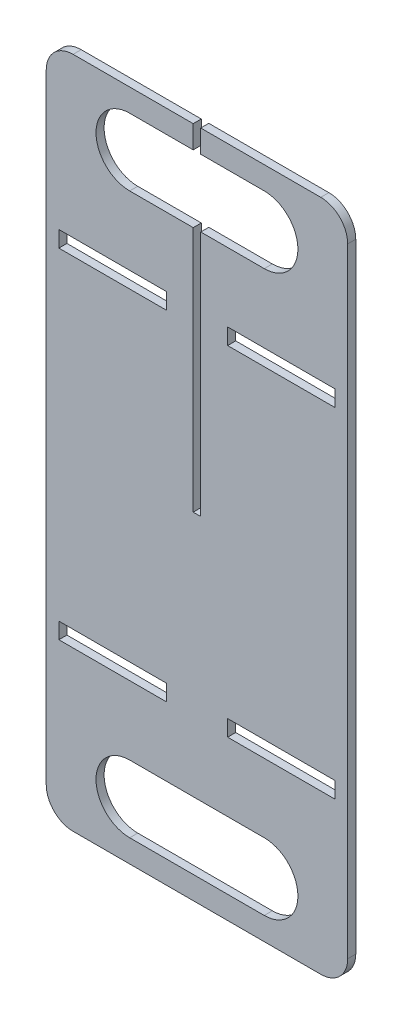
ISO-10303-21;
HEADER;
FILE_DESCRIPTION(('STEP AP214'),'2;1');
FILE_NAME('part.step','',(''),(''),'','','');
FILE_SCHEMA(('AUTOMOTIVE_DESIGN { 1 0 10303 214 1 1 1 1 }'));
ENDSEC;
DATA;
#1=APPLICATION_CONTEXT('core data for automotive mechanical design processes');
#2=APPLICATION_PROTOCOL_DEFINITION('international standard','automotive_design',2000,#1);
#3=PRODUCT_CONTEXT('',#1,'mechanical');
#4=PRODUCT('Part','Part','',(#3));
#5=PRODUCT_RELATED_PRODUCT_CATEGORY('part','',(#4));
#6=PRODUCT_DEFINITION_FORMATION('','',#4);
#7=PRODUCT_DEFINITION_CONTEXT('part definition',#1,'design');
#8=PRODUCT_DEFINITION('design','',#6,#7);
#9=PRODUCT_DEFINITION_SHAPE('','',#8);
#10=(LENGTH_UNIT() NAMED_UNIT(*) SI_UNIT(.MILLI.,.METRE.));
#11=(NAMED_UNIT(*) PLANE_ANGLE_UNIT() SI_UNIT($,.RADIAN.));
#12=(NAMED_UNIT(*) SI_UNIT($,.STERADIAN.) SOLID_ANGLE_UNIT());
#13=UNCERTAINTY_MEASURE_WITH_UNIT(LENGTH_MEASURE(1.E-05),#10,'distance_accuracy_value','');
#14=(GEOMETRIC_REPRESENTATION_CONTEXT(3) GLOBAL_UNCERTAINTY_ASSIGNED_CONTEXT((#13)) GLOBAL_UNIT_ASSIGNED_CONTEXT((#10,
#11,#12)) REPRESENTATION_CONTEXT('',''));
#15=CARTESIAN_POINT('',(0.,0.,0.));
#16=DIRECTION('',(0.,0.,1.));
#17=DIRECTION('',(1.,0.,0.));
#18=AXIS2_PLACEMENT_3D('',#15,#16,#17);
#19=CARTESIAN_POINT('',(0.,0.,3.));
#20=DIRECTION('',(0.,0.,-1.));
#21=DIRECTION('',(-1.,0.,0.));
#22=AXIS2_PLACEMENT_3D('',#19,#20,#21);
#23=PLANE('',#22);
#24=DIRECTION('',(1.,0.,0.));
#25=VECTOR('',#24,1.);
#26=CARTESIAN_POINT('',(25.,-91.5535472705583,3.));
#27=LINE('',#26,#25);
#28=CARTESIAN_POINT('',(-25.,-91.5535472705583,3.));
#29=VERTEX_POINT('',#28);
#30=CARTESIAN_POINT('',(25.,-91.5535472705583,3.));
#31=VERTEX_POINT('',#30);
#32=EDGE_CURVE('E347',#29,#31,#27,.T.);
#33=ORIENTED_EDGE('',*,*,#32,.T.);
#34=CARTESIAN_POINT('',(25.,-104.053547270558,3.));
#35=DIRECTION('',(0.,0.,-1.));
#36=DIRECTION('',(-1.,0.,0.));
#37=AXIS2_PLACEMENT_3D('',#34,#35,#36);
#38=CIRCLE('',#37,12.5);
#39=CARTESIAN_POINT('',(25.,-116.553547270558,3.));
#40=VERTEX_POINT('',#39);
#41=EDGE_CURVE('E337',#31,#40,#38,.T.);
#42=ORIENTED_EDGE('',*,*,#41,.T.);
#43=DIRECTION('',(-1.,0.,0.));
#44=VECTOR('',#43,1.);
#45=CARTESIAN_POINT('',(25.,-116.553547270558,3.));
#46=LINE('',#45,#44);
#47=CARTESIAN_POINT('',(-25.,-116.553547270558,3.));
#48=VERTEX_POINT('',#47);
#49=EDGE_CURVE('E340',#40,#48,#46,.T.);
#50=ORIENTED_EDGE('',*,*,#49,.T.);
#51=CARTESIAN_POINT('',(-25.,-104.053547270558,3.));
#52=DIRECTION('',(0.,0.,-1.));
#53=DIRECTION('',(-1.,0.,0.));
#54=AXIS2_PLACEMENT_3D('',#51,#52,#53);
#55=CIRCLE('',#54,12.5);
#56=EDGE_CURVE('E344',#48,#29,#55,.T.);
#57=ORIENTED_EDGE('',*,*,#56,.T.);
#58=EDGE_LOOP('',(#33,#42,#50,#57));
#59=FACE_BOUND('',#58,.T.);
#60=DIRECTION('',(0.,1.,0.));
#61=VECTOR('',#60,1.);
#62=CARTESIAN_POINT('',(-11.4,-59.9999999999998,3.));
#63=LINE('',#62,#61);
#64=CARTESIAN_POINT('',(-11.4,-65.9999999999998,3.));
#65=VERTEX_POINT('',#64);
#66=CARTESIAN_POINT('',(-11.4,-59.9999999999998,3.));
#67=VERTEX_POINT('',#66);
#68=EDGE_CURVE('E402',#65,#67,#63,.T.);
#69=ORIENTED_EDGE('',*,*,#68,.F.);
#70=DIRECTION('',(1.,0.,0.));
#71=VECTOR('',#70,1.);
#72=CARTESIAN_POINT('',(-11.4,-65.9999999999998,3.));
#73=LINE('',#72,#71);
#74=CARTESIAN_POINT('',(-51.3,-65.9999999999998,3.));
#75=VERTEX_POINT('',#74);
#76=EDGE_CURVE('E404',#75,#65,#73,.T.);
#77=ORIENTED_EDGE('',*,*,#76,.F.);
#78=DIRECTION('',(0.,-1.,0.));
#79=VECTOR('',#78,1.);
#80=CARTESIAN_POINT('',(-51.3,-59.9999999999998,3.));
#81=LINE('',#80,#79);
#82=CARTESIAN_POINT('',(-51.3,-59.9999999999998,3.));
#83=VERTEX_POINT('',#82);
#84=EDGE_CURVE('E407',#83,#75,#81,.T.);
#85=ORIENTED_EDGE('',*,*,#84,.F.);
#86=DIRECTION('',(-1.,0.,0.));
#87=VECTOR('',#86,1.);
#88=CARTESIAN_POINT('',(-11.4,-59.9999999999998,3.));
#89=LINE('',#88,#87);
#90=EDGE_CURVE('E410',#67,#83,#89,.T.);
#91=ORIENTED_EDGE('',*,*,#90,.F.);
#92=EDGE_LOOP('',(#69,#77,#85,#91));
#93=FACE_BOUND('',#92,.T.);
#94=DIRECTION('',(1.,0.,0.));
#95=VECTOR('',#94,1.);
#96=CARTESIAN_POINT('',(51.3,66.0000000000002,3.));
#97=LINE('',#96,#95);
#98=CARTESIAN_POINT('',(11.4,66.0000000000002,3.));
#99=VERTEX_POINT('',#98);
#100=CARTESIAN_POINT('',(51.3,66.0000000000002,3.));
#101=VERTEX_POINT('',#100);
#102=EDGE_CURVE('E441',#99,#101,#97,.T.);
#103=ORIENTED_EDGE('',*,*,#102,.T.);
#104=DIRECTION('',(0.,-1.,0.));
#105=VECTOR('',#104,1.);
#106=CARTESIAN_POINT('',(51.3,66.0000000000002,3.));
#107=LINE('',#106,#105);
#108=CARTESIAN_POINT('',(51.3,60.0000000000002,3.));
#109=VERTEX_POINT('',#108);
#110=EDGE_CURVE('E431',#101,#109,#107,.T.);
#111=ORIENTED_EDGE('',*,*,#110,.T.);
#112=DIRECTION('',(-1.,0.,0.));
#113=VECTOR('',#112,1.);
#114=CARTESIAN_POINT('',(51.3,60.0000000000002,3.));
#115=LINE('',#114,#113);
#116=CARTESIAN_POINT('',(11.4,60.0000000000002,3.));
#117=VERTEX_POINT('',#116);
#118=EDGE_CURVE('E434',#109,#117,#115,.T.);
#119=ORIENTED_EDGE('',*,*,#118,.T.);
#120=DIRECTION('',(0.,1.,0.));
#121=VECTOR('',#120,1.);
#122=CARTESIAN_POINT('',(11.4,66.0000000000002,3.));
#123=LINE('',#122,#121);
#124=EDGE_CURVE('E438',#117,#99,#123,.T.);
#125=ORIENTED_EDGE('',*,*,#124,.T.);
#126=EDGE_LOOP('',(#103,#111,#119,#125));
#127=FACE_BOUND('',#126,.T.);
#128=DIRECTION('',(-1.,0.,0.));
#129=VECTOR('',#128,1.);
#130=CARTESIAN_POINT('',(11.4,-65.9999999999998,3.));
#131=LINE('',#130,#129);
#132=CARTESIAN_POINT('',(51.3,-65.9999999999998,3.));
#133=VERTEX_POINT('',#132);
#134=CARTESIAN_POINT('',(11.4,-65.9999999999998,3.));
#135=VERTEX_POINT('',#134);
#136=EDGE_CURVE('E475',#133,#135,#131,.T.);
#137=ORIENTED_EDGE('',*,*,#136,.T.);
#138=DIRECTION('',(0.,1.,0.));
#139=VECTOR('',#138,1.);
#140=CARTESIAN_POINT('',(11.4,-59.9999999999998,3.));
#141=LINE('',#140,#139);
#142=CARTESIAN_POINT('',(11.4,-59.9999999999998,3.));
#143=VERTEX_POINT('',#142);
#144=EDGE_CURVE('E465',#135,#143,#141,.T.);
#145=ORIENTED_EDGE('',*,*,#144,.T.);
#146=DIRECTION('',(1.,0.,0.));
#147=VECTOR('',#146,1.);
#148=CARTESIAN_POINT('',(11.4,-59.9999999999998,3.));
#149=LINE('',#148,#147);
#150=CARTESIAN_POINT('',(51.3,-59.9999999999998,3.));
#151=VERTEX_POINT('',#150);
#152=EDGE_CURVE('E468',#143,#151,#149,.T.);
#153=ORIENTED_EDGE('',*,*,#152,.T.);
#154=DIRECTION('',(0.,-1.,0.));
#155=VECTOR('',#154,1.);
#156=CARTESIAN_POINT('',(51.3,-59.9999999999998,3.));
#157=LINE('',#156,#155);
#158=EDGE_CURVE('E472',#151,#133,#157,.T.);
#159=ORIENTED_EDGE('',*,*,#158,.T.);
#160=EDGE_LOOP('',(#137,#145,#153,#159));
#161=FACE_BOUND('',#160,.T.);
#162=DIRECTION('',(0.,-1.,0.));
#163=VECTOR('',#162,1.);
#164=CARTESIAN_POINT('',(-51.3,66.0000000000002,3.));
#165=LINE('',#164,#163);
#166=CARTESIAN_POINT('',(-51.3,66.0000000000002,3.));
#167=VERTEX_POINT('',#166);
#168=CARTESIAN_POINT('',(-51.3,60.0000000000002,3.));
#169=VERTEX_POINT('',#168);
#170=EDGE_CURVE('E369',#167,#169,#165,.T.);
#171=ORIENTED_EDGE('',*,*,#170,.F.);
#172=DIRECTION('',(-1.,0.,0.));
#173=VECTOR('',#172,1.);
#174=CARTESIAN_POINT('',(-51.3,66.0000000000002,3.));
#175=LINE('',#174,#173);
#176=CARTESIAN_POINT('',(-11.4,66.0000000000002,3.));
#177=VERTEX_POINT('',#176);
#178=EDGE_CURVE('E371',#177,#167,#175,.T.);
#179=ORIENTED_EDGE('',*,*,#178,.F.);
#180=DIRECTION('',(0.,1.,0.));
#181=VECTOR('',#180,1.);
#182=CARTESIAN_POINT('',(-11.4,66.0000000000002,3.));
#183=LINE('',#182,#181);
#184=CARTESIAN_POINT('',(-11.4,60.0000000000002,3.));
#185=VERTEX_POINT('',#184);
#186=EDGE_CURVE('E374',#185,#177,#183,.T.);
#187=ORIENTED_EDGE('',*,*,#186,.F.);
#188=DIRECTION('',(1.,0.,0.));
#189=VECTOR('',#188,1.);
#190=CARTESIAN_POINT('',(-51.3,60.0000000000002,3.));
#191=LINE('',#190,#189);
#192=EDGE_CURVE('E377',#169,#185,#191,.T.);
#193=ORIENTED_EDGE('',*,*,#192,.F.);
#194=EDGE_LOOP('',(#171,#179,#187,#193));
#195=FACE_BOUND('',#194,.T.);
#196=DIRECTION('',(-1.,0.,0.));
#197=VECTOR('',#196,1.);
#198=CARTESIAN_POINT('',(25.,116.553547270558,3.));
#199=LINE('',#198,#197);
#200=CARTESIAN_POINT('',(-1.40000000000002,116.553547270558,3.));
#201=VERTEX_POINT('',#200);
#202=CARTESIAN_POINT('',(-25.,116.553547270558,3.));
#203=VERTEX_POINT('',#202);
#204=EDGE_CURVE('E319',#201,#203,#199,.T.);
#205=ORIENTED_EDGE('',*,*,#204,.F.);
#206=DIRECTION('',(0.,1.,0.));
#207=VECTOR('',#206,1.);
#208=CARTESIAN_POINT('',(-1.40000000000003,125.,3.));
#209=LINE('',#208,#207);
#210=CARTESIAN_POINT('',(-1.40000000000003,125.,3.));
#211=VERTEX_POINT('',#210);
#212=EDGE_CURVE('E506',#201,#211,#209,.T.);
#213=ORIENTED_EDGE('',*,*,#212,.T.);
#214=DIRECTION('',(-1.,0.,0.));
#215=VECTOR('',#214,1.);
#216=CARTESIAN_POINT('',(-56.0000000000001,125.,3.));
#217=LINE('',#216,#215);
#218=CARTESIAN_POINT('',(-46.0000000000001,125.,3.));
#219=VERTEX_POINT('',#218);
#220=EDGE_CURVE('E510',#211,#219,#217,.T.);
#221=ORIENTED_EDGE('',*,*,#220,.T.);
#222=CARTESIAN_POINT('',(-46.0000000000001,115.,3.));
#223=DIRECTION('',(0.,0.,-1.));
#224=DIRECTION('',(-1.,0.,0.));
#225=AXIS2_PLACEMENT_3D('',#222,#223,#224);
#226=CIRCLE('',#225,10.);
#227=CARTESIAN_POINT('',(-56.0000000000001,115.,3.));
#228=VERTEX_POINT('',#227);
#229=EDGE_CURVE('E573',#219,#228,#226,.F.);
#230=ORIENTED_EDGE('',*,*,#229,.T.);
#231=DIRECTION('',(0.,-1.,0.));
#232=VECTOR('',#231,1.);
#233=CARTESIAN_POINT('',(-56.0000000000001,-125.,3.));
#234=LINE('',#233,#232);
#235=CARTESIAN_POINT('',(-56.0000000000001,-115.,3.));
#236=VERTEX_POINT('',#235);
#237=EDGE_CURVE('E513',#228,#236,#234,.T.);
#238=ORIENTED_EDGE('',*,*,#237,.T.);
#239=CARTESIAN_POINT('',(-46.0000000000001,-115.,3.));
#240=DIRECTION('',(0.,0.,-1.));
#241=DIRECTION('',(-1.,0.,0.));
#242=AXIS2_PLACEMENT_3D('',#239,#240,#241);
#243=CIRCLE('',#242,10.);
#244=CARTESIAN_POINT('',(-46.0000000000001,-125.,3.));
#245=VERTEX_POINT('',#244);
#246=EDGE_CURVE('E577',#236,#245,#243,.F.);
#247=ORIENTED_EDGE('',*,*,#246,.T.);
#248=DIRECTION('',(1.,0.,0.));
#249=VECTOR('',#248,1.);
#250=CARTESIAN_POINT('',(-56.0000000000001,-125.,3.));
#251=LINE('',#250,#249);
#252=CARTESIAN_POINT('',(45.9999999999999,-125.,3.));
#253=VERTEX_POINT('',#252);
#254=EDGE_CURVE('E516',#245,#253,#251,.T.);
#255=ORIENTED_EDGE('',*,*,#254,.T.);
#256=CARTESIAN_POINT('',(45.9999999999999,-115.,3.));
#257=DIRECTION('',(0.,0.,-1.));
#258=DIRECTION('',(-1.,0.,0.));
#259=AXIS2_PLACEMENT_3D('',#256,#257,#258);
#260=CIRCLE('',#259,10.);
#261=CARTESIAN_POINT('',(55.9999999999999,-115.,3.));
#262=VERTEX_POINT('',#261);
#263=EDGE_CURVE('E575',#253,#262,#260,.F.);
#264=ORIENTED_EDGE('',*,*,#263,.T.);
#265=DIRECTION('',(0.,1.,0.));
#266=VECTOR('',#265,1.);
#267=CARTESIAN_POINT('',(55.9999999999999,-125.,3.));
#268=LINE('',#267,#266);
#269=CARTESIAN_POINT('',(55.9999999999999,115.,3.));
#270=VERTEX_POINT('',#269);
#271=EDGE_CURVE('E495',#262,#270,#268,.T.);
#272=ORIENTED_EDGE('',*,*,#271,.T.);
#273=CARTESIAN_POINT('',(45.9999999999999,115.,3.));
#274=DIRECTION('',(0.,0.,-1.));
#275=DIRECTION('',(-1.,0.,0.));
#276=AXIS2_PLACEMENT_3D('',#273,#274,#275);
#277=CIRCLE('',#276,10.);
#278=CARTESIAN_POINT('',(45.9999999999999,125.,3.));
#279=VERTEX_POINT('',#278);
#280=EDGE_CURVE('E571',#270,#279,#277,.F.);
#281=ORIENTED_EDGE('',*,*,#280,.T.);
#282=DIRECTION('',(-1.,0.,0.));
#283=VECTOR('',#282,1.);
#284=CARTESIAN_POINT('',(1.39999999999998,125.,3.));
#285=LINE('',#284,#283);
#286=CARTESIAN_POINT('',(1.39999999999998,125.,3.));
#287=VERTEX_POINT('',#286);
#288=EDGE_CURVE('E498',#279,#287,#285,.T.);
#289=ORIENTED_EDGE('',*,*,#288,.T.);
#290=DIRECTION('',(0.,-1.,0.));
#291=VECTOR('',#290,1.);
#292=CARTESIAN_POINT('',(1.39999999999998,125.,3.));
#293=LINE('',#292,#291);
#294=CARTESIAN_POINT('',(1.39999999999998,116.553547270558,3.));
#295=VERTEX_POINT('',#294);
#296=EDGE_CURVE('E502',#287,#295,#293,.T.);
#297=ORIENTED_EDGE('',*,*,#296,.T.);
#298=CARTESIAN_POINT('',(25.,116.553547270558,3.));
#299=VERTEX_POINT('',#298);
#300=EDGE_CURVE('E306',#299,#295,#199,.T.);
#301=ORIENTED_EDGE('',*,*,#300,.F.);
#302=CARTESIAN_POINT('',(25.,104.053547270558,3.));
#303=DIRECTION('',(0.,0.,1.));
#304=DIRECTION('',(-1.,0.,0.));
#305=AXIS2_PLACEMENT_3D('',#302,#303,#304);
#306=CIRCLE('',#305,12.5);
#307=CARTESIAN_POINT('',(25.,91.5535472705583,3.));
#308=VERTEX_POINT('',#307);
#309=EDGE_CURVE('E297',#308,#299,#306,.T.);
#310=ORIENTED_EDGE('',*,*,#309,.F.);
#311=DIRECTION('',(1.,0.,0.));
#312=VECTOR('',#311,1.);
#313=CARTESIAN_POINT('',(25.,91.5535472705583,3.));
#314=LINE('',#313,#312);
#315=CARTESIAN_POINT('',(1.39999999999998,91.5535472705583,3.));
#316=VERTEX_POINT('',#315);
#317=EDGE_CURVE('E288',#316,#308,#314,.T.);
#318=ORIENTED_EDGE('',*,*,#317,.F.);
#319=CARTESIAN_POINT('',(1.39999999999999,0.,3.));
#320=VERTEX_POINT('',#319);
#321=EDGE_CURVE('E501',#316,#320,#293,.T.);
#322=ORIENTED_EDGE('',*,*,#321,.T.);
#323=DIRECTION('',(-1.,0.,0.));
#324=VECTOR('',#323,1.);
#325=CARTESIAN_POINT('',(-1.39999999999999,0.,3.));
#326=LINE('',#325,#324);
#327=CARTESIAN_POINT('',(-1.39999999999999,0.,3.));
#328=VERTEX_POINT('',#327);
#329=EDGE_CURVE('E504',#320,#328,#326,.T.);
#330=ORIENTED_EDGE('',*,*,#329,.T.);
#331=CARTESIAN_POINT('',(-1.40000000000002,91.5535472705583,3.));
#332=VERTEX_POINT('',#331);
#333=EDGE_CURVE('E507',#328,#332,#209,.T.);
#334=ORIENTED_EDGE('',*,*,#333,.T.);
#335=CARTESIAN_POINT('',(-25.,91.5535472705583,3.));
#336=VERTEX_POINT('',#335);
#337=EDGE_CURVE('E56',#336,#332,#314,.T.);
#338=ORIENTED_EDGE('',*,*,#337,.F.);
#339=CARTESIAN_POINT('',(-25.,104.053547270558,3.));
#340=DIRECTION('',(0.,0.,1.));
#341=DIRECTION('',(-1.,0.,0.));
#342=AXIS2_PLACEMENT_3D('',#339,#340,#341);
#343=CIRCLE('',#342,12.5);
#344=EDGE_CURVE('E317',#203,#336,#343,.T.);
#345=ORIENTED_EDGE('',*,*,#344,.F.);
#346=EDGE_LOOP('',(#205,#213,#221,#230,#238,#247,#255,#264,#272,#281,#289,#297,#301,#310,#318,
#322,#330,#334,#338,#345));
#347=FACE_BOUND('',#346,.T.);
#348=ADVANCED_FACE('F33',(#59,#93,#127,#161,#195,#347),#23,.F.);
#349=CARTESIAN_POINT('',(0.,0.,0.));
#350=DIRECTION('',(0.,0.,-1.));
#351=DIRECTION('',(-1.,0.,0.));
#352=AXIS2_PLACEMENT_3D('',#349,#350,#351);
#353=PLANE('',#352);
#354=CARTESIAN_POINT('',(25.,-104.053547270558,0.));
#355=DIRECTION('',(0.,0.,-1.));
#356=DIRECTION('',(-1.,0.,0.));
#357=AXIS2_PLACEMENT_3D('',#354,#355,#356);
#358=CIRCLE('',#357,12.5);
#359=CARTESIAN_POINT('',(25.,-91.5535472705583,0.));
#360=VERTEX_POINT('',#359);
#361=CARTESIAN_POINT('',(25.,-116.553547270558,0.));
#362=VERTEX_POINT('',#361);
#363=EDGE_CURVE('E336',#360,#362,#358,.T.);
#364=ORIENTED_EDGE('',*,*,#363,.F.);
#365=DIRECTION('',(1.,0.,0.));
#366=VECTOR('',#365,1.);
#367=CARTESIAN_POINT('',(25.,-91.5535472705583,0.));
#368=LINE('',#367,#366);
#369=CARTESIAN_POINT('',(-25.,-91.5535472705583,0.));
#370=VERTEX_POINT('',#369);
#371=EDGE_CURVE('E341',#370,#360,#368,.T.);
#372=ORIENTED_EDGE('',*,*,#371,.F.);
#373=CARTESIAN_POINT('',(-25.,-104.053547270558,0.));
#374=DIRECTION('',(0.,0.,-1.));
#375=DIRECTION('',(-1.,0.,0.));
#376=AXIS2_PLACEMENT_3D('',#373,#374,#375);
#377=CIRCLE('',#376,12.5);
#378=CARTESIAN_POINT('',(-25.,-116.553547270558,0.));
#379=VERTEX_POINT('',#378);
#380=EDGE_CURVE('E355',#379,#370,#377,.T.);
#381=ORIENTED_EDGE('',*,*,#380,.F.);
#382=DIRECTION('',(-1.,0.,0.));
#383=VECTOR('',#382,1.);
#384=CARTESIAN_POINT('',(25.,-116.553547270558,0.));
#385=LINE('',#384,#383);
#386=EDGE_CURVE('E352',#362,#379,#385,.T.);
#387=ORIENTED_EDGE('',*,*,#386,.F.);
#388=EDGE_LOOP('',(#364,#372,#381,#387));
#389=FACE_BOUND('',#388,.T.);
#390=DIRECTION('',(0.,-1.,0.));
#391=VECTOR('',#390,1.);
#392=CARTESIAN_POINT('',(51.3,66.0000000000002,0.));
#393=LINE('',#392,#391);
#394=CARTESIAN_POINT('',(51.3,66.0000000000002,0.));
#395=VERTEX_POINT('',#394);
#396=CARTESIAN_POINT('',(51.3,60.0000000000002,0.));
#397=VERTEX_POINT('',#396);
#398=EDGE_CURVE('E445',#395,#397,#393,.T.);
#399=ORIENTED_EDGE('',*,*,#398,.F.);
#400=DIRECTION('',(1.,0.,0.));
#401=VECTOR('',#400,1.);
#402=CARTESIAN_POINT('',(51.3,66.0000000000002,0.));
#403=LINE('',#402,#401);
#404=CARTESIAN_POINT('',(11.4,66.0000000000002,0.));
#405=VERTEX_POINT('',#404);
#406=EDGE_CURVE('E435',#405,#395,#403,.T.);
#407=ORIENTED_EDGE('',*,*,#406,.F.);
#408=DIRECTION('',(0.,1.,0.));
#409=VECTOR('',#408,1.);
#410=CARTESIAN_POINT('',(11.4,66.0000000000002,0.));
#411=LINE('',#410,#409);
#412=CARTESIAN_POINT('',(11.4,60.0000000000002,0.));
#413=VERTEX_POINT('',#412);
#414=EDGE_CURVE('E451',#413,#405,#411,.T.);
#415=ORIENTED_EDGE('',*,*,#414,.F.);
#416=DIRECTION('',(-1.,0.,0.));
#417=VECTOR('',#416,1.);
#418=CARTESIAN_POINT('',(51.3,60.0000000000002,0.));
#419=LINE('',#418,#417);
#420=EDGE_CURVE('E447',#397,#413,#419,.T.);
#421=ORIENTED_EDGE('',*,*,#420,.F.);
#422=EDGE_LOOP('',(#399,#407,#415,#421));
#423=FACE_BOUND('',#422,.T.);
#424=DIRECTION('',(0.,1.,0.));
#425=VECTOR('',#424,1.);
#426=CARTESIAN_POINT('',(11.4,-59.9999999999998,0.));
#427=LINE('',#426,#425);
#428=CARTESIAN_POINT('',(11.4,-65.9999999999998,0.));
#429=VERTEX_POINT('',#428);
#430=CARTESIAN_POINT('',(11.4,-59.9999999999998,0.));
#431=VERTEX_POINT('',#430);
#432=EDGE_CURVE('E395',#429,#431,#427,.T.);
#433=ORIENTED_EDGE('',*,*,#432,.F.);
#434=DIRECTION('',(-1.,0.,0.));
#435=VECTOR('',#434,1.);
#436=CARTESIAN_POINT('',(11.4,-65.9999999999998,0.));
#437=LINE('',#436,#435);
#438=CARTESIAN_POINT('',(51.3,-65.9999999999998,0.));
#439=VERTEX_POINT('',#438);
#440=EDGE_CURVE('E469',#439,#429,#437,.T.);
#441=ORIENTED_EDGE('',*,*,#440,.F.);
#442=DIRECTION('',(0.,-1.,0.));
#443=VECTOR('',#442,1.);
#444=CARTESIAN_POINT('',(51.3,-59.9999999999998,0.));
#445=LINE('',#444,#443);
#446=CARTESIAN_POINT('',(51.3,-59.9999999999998,0.));
#447=VERTEX_POINT('',#446);
#448=EDGE_CURVE('E483',#447,#439,#445,.T.);
#449=ORIENTED_EDGE('',*,*,#448,.F.);
#450=DIRECTION('',(1.,0.,0.));
#451=VECTOR('',#450,1.);
#452=CARTESIAN_POINT('',(11.4,-59.9999999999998,0.));
#453=LINE('',#452,#451);
#454=EDGE_CURVE('E480',#431,#447,#453,.T.);
#455=ORIENTED_EDGE('',*,*,#454,.F.);
#456=EDGE_LOOP('',(#433,#441,#449,#455));
#457=FACE_BOUND('',#456,.T.);
#458=DIRECTION('',(1.,0.,0.));
#459=VECTOR('',#458,1.);
#460=CARTESIAN_POINT('',(-11.4,-65.9999999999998,0.));
#461=LINE('',#460,#459);
#462=CARTESIAN_POINT('',(-51.3,-65.9999999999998,0.));
#463=VERTEX_POINT('',#462);
#464=CARTESIAN_POINT('',(-11.4,-65.9999999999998,0.));
#465=VERTEX_POINT('',#464);
#466=EDGE_CURVE('E415',#463,#465,#461,.T.);
#467=ORIENTED_EDGE('',*,*,#466,.T.);
#468=DIRECTION('',(0.,1.,0.));
#469=VECTOR('',#468,1.);
#470=CARTESIAN_POINT('',(-11.4,-59.9999999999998,0.));
#471=LINE('',#470,#469);
#472=CARTESIAN_POINT('',(-11.4,-59.9999999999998,0.));
#473=VERTEX_POINT('',#472);
#474=EDGE_CURVE('E362',#465,#473,#471,.T.);
#475=ORIENTED_EDGE('',*,*,#474,.T.);
#476=DIRECTION('',(-1.,0.,0.));
#477=VECTOR('',#476,1.);
#478=CARTESIAN_POINT('',(-11.4,-59.9999999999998,0.));
#479=LINE('',#478,#477);
#480=CARTESIAN_POINT('',(-51.3,-59.9999999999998,0.));
#481=VERTEX_POINT('',#480);
#482=EDGE_CURVE('E405',#473,#481,#479,.T.);
#483=ORIENTED_EDGE('',*,*,#482,.T.);
#484=DIRECTION('',(0.,-1.,0.));
#485=VECTOR('',#484,1.);
#486=CARTESIAN_POINT('',(-51.3,-59.9999999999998,0.));
#487=LINE('',#486,#485);
#488=EDGE_CURVE('E418',#481,#463,#487,.T.);
#489=ORIENTED_EDGE('',*,*,#488,.T.);
#490=EDGE_LOOP('',(#467,#475,#483,#489));
#491=FACE_BOUND('',#490,.T.);
#492=DIRECTION('',(-1.,0.,0.));
#493=VECTOR('',#492,1.);
#494=CARTESIAN_POINT('',(-51.3,66.0000000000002,0.));
#495=LINE('',#494,#493);
#496=CARTESIAN_POINT('',(-11.4,66.0000000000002,0.));
#497=VERTEX_POINT('',#496);
#498=CARTESIAN_POINT('',(-51.3,66.0000000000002,0.));
#499=VERTEX_POINT('',#498);
#500=EDGE_CURVE('E383',#497,#499,#495,.T.);
#501=ORIENTED_EDGE('',*,*,#500,.T.);
#502=DIRECTION('',(0.,-1.,0.));
#503=VECTOR('',#502,1.);
#504=CARTESIAN_POINT('',(-51.3,66.0000000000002,0.));
#505=LINE('',#504,#503);
#506=CARTESIAN_POINT('',(-51.3,60.0000000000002,0.));
#507=VERTEX_POINT('',#506);
#508=EDGE_CURVE('E380',#499,#507,#505,.T.);
#509=ORIENTED_EDGE('',*,*,#508,.T.);
#510=DIRECTION('',(1.,0.,0.));
#511=VECTOR('',#510,1.);
#512=CARTESIAN_POINT('',(-51.3,60.0000000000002,0.));
#513=LINE('',#512,#511);
#514=CARTESIAN_POINT('',(-11.4,60.0000000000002,0.));
#515=VERTEX_POINT('',#514);
#516=EDGE_CURVE('E372',#507,#515,#513,.T.);
#517=ORIENTED_EDGE('',*,*,#516,.T.);
#518=DIRECTION('',(0.,1.,0.));
#519=VECTOR('',#518,1.);
#520=CARTESIAN_POINT('',(-11.4,66.0000000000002,0.));
#521=LINE('',#520,#519);
#522=EDGE_CURVE('E387',#515,#497,#521,.T.);
#523=ORIENTED_EDGE('',*,*,#522,.T.);
#524=EDGE_LOOP('',(#501,#509,#517,#523));
#525=FACE_BOUND('',#524,.T.);
#526=DIRECTION('',(0.,1.,0.));
#527=VECTOR('',#526,1.);
#528=CARTESIAN_POINT('',(-1.40000000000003,125.,0.));
#529=LINE('',#528,#527);
#530=CARTESIAN_POINT('',(-1.40000000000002,116.553547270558,0.));
#531=VERTEX_POINT('',#530);
#532=CARTESIAN_POINT('',(-1.40000000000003,125.,0.));
#533=VERTEX_POINT('',#532);
#534=EDGE_CURVE('E530',#531,#533,#529,.T.);
#535=ORIENTED_EDGE('',*,*,#534,.F.);
#536=DIRECTION('',(-1.,0.,0.));
#537=VECTOR('',#536,1.);
#538=CARTESIAN_POINT('',(25.,116.553547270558,0.));
#539=LINE('',#538,#537);
#540=CARTESIAN_POINT('',(-25.,116.553547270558,0.));
#541=VERTEX_POINT('',#540);
#542=EDGE_CURVE('E314',#531,#541,#539,.T.);
#543=ORIENTED_EDGE('',*,*,#542,.T.);
#544=CARTESIAN_POINT('',(-25.,104.053547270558,0.));
#545=DIRECTION('',(0.,0.,1.));
#546=DIRECTION('',(-1.,0.,0.));
#547=AXIS2_PLACEMENT_3D('',#544,#545,#546);
#548=CIRCLE('',#547,12.5);
#549=CARTESIAN_POINT('',(-25.,91.5535472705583,0.));
#550=VERTEX_POINT('',#549);
#551=EDGE_CURVE('E325',#541,#550,#548,.T.);
#552=ORIENTED_EDGE('',*,*,#551,.T.);
#553=DIRECTION('',(1.,0.,0.));
#554=VECTOR('',#553,1.);
#555=CARTESIAN_POINT('',(25.,91.5535472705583,0.));
#556=LINE('',#555,#554);
#557=CARTESIAN_POINT('',(-1.40000000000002,91.5535472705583,0.));
#558=VERTEX_POINT('',#557);
#559=EDGE_CURVE('E322',#550,#558,#556,.T.);
#560=ORIENTED_EDGE('',*,*,#559,.T.);
#561=CARTESIAN_POINT('',(-1.39999999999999,0.,0.));
#562=VERTEX_POINT('',#561);
#563=EDGE_CURVE('E531',#562,#558,#529,.T.);
#564=ORIENTED_EDGE('',*,*,#563,.F.);
#565=DIRECTION('',(-1.,0.,0.));
#566=VECTOR('',#565,1.);
#567=CARTESIAN_POINT('',(-1.39999999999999,0.,0.));
#568=LINE('',#567,#566);
#569=CARTESIAN_POINT('',(1.39999999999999,0.,0.));
#570=VERTEX_POINT('',#569);
#571=EDGE_CURVE('E528',#570,#562,#568,.T.);
#572=ORIENTED_EDGE('',*,*,#571,.F.);
#573=DIRECTION('',(0.,-1.,0.));
#574=VECTOR('',#573,1.);
#575=CARTESIAN_POINT('',(1.39999999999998,125.,0.));
#576=LINE('',#575,#574);
#577=CARTESIAN_POINT('',(1.39999999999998,91.5535472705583,0.));
#578=VERTEX_POINT('',#577);
#579=EDGE_CURVE('E524',#578,#570,#576,.T.);
#580=ORIENTED_EDGE('',*,*,#579,.F.);
#581=CARTESIAN_POINT('',(25.,91.5535472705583,0.));
#582=VERTEX_POINT('',#581);
#583=EDGE_CURVE('E48',#578,#582,#556,.T.);
#584=ORIENTED_EDGE('',*,*,#583,.T.);
#585=CARTESIAN_POINT('',(25.,104.053547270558,0.));
#586=DIRECTION('',(0.,0.,1.));
#587=DIRECTION('',(-1.,0.,0.));
#588=AXIS2_PLACEMENT_3D('',#585,#586,#587);
#589=CIRCLE('',#588,12.5);
#590=CARTESIAN_POINT('',(25.,116.553547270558,0.));
#591=VERTEX_POINT('',#590);
#592=EDGE_CURVE('E304',#582,#591,#589,.T.);
#593=ORIENTED_EDGE('',*,*,#592,.T.);
#594=CARTESIAN_POINT('',(1.39999999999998,116.553547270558,0.));
#595=VERTEX_POINT('',#594);
#596=EDGE_CURVE('E311',#591,#595,#539,.T.);
#597=ORIENTED_EDGE('',*,*,#596,.T.);
#598=CARTESIAN_POINT('',(1.39999999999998,125.,0.));
#599=VERTEX_POINT('',#598);
#600=EDGE_CURVE('E525',#599,#595,#576,.T.);
#601=ORIENTED_EDGE('',*,*,#600,.F.);
#602=DIRECTION('',(-1.,0.,0.));
#603=VECTOR('',#602,1.);
#604=CARTESIAN_POINT('',(1.39999999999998,125.,0.));
#605=LINE('',#604,#603);
#606=CARTESIAN_POINT('',(45.9999999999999,125.,0.));
#607=VERTEX_POINT('',#606);
#608=EDGE_CURVE('E522',#607,#599,#605,.T.);
#609=ORIENTED_EDGE('',*,*,#608,.F.);
#610=CARTESIAN_POINT('',(45.9999999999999,115.,0.));
#611=DIRECTION('',(0.,0.,-1.));
#612=DIRECTION('',(-1.,0.,0.));
#613=AXIS2_PLACEMENT_3D('',#610,#611,#612);
#614=CIRCLE('',#613,10.);
#615=CARTESIAN_POINT('',(55.9999999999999,115.,0.));
#616=VERTEX_POINT('',#615);
#617=EDGE_CURVE('E558',#607,#616,#614,.T.);
#618=ORIENTED_EDGE('',*,*,#617,.T.);
#619=DIRECTION('',(0.,1.,0.));
#620=VECTOR('',#619,1.);
#621=CARTESIAN_POINT('',(55.9999999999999,-125.,0.));
#622=LINE('',#621,#620);
#623=CARTESIAN_POINT('',(55.9999999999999,-115.,0.));
#624=VERTEX_POINT('',#623);
#625=EDGE_CURVE('E458',#624,#616,#622,.T.);
#626=ORIENTED_EDGE('',*,*,#625,.F.);
#627=CARTESIAN_POINT('',(45.9999999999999,-115.,0.));
#628=DIRECTION('',(0.,0.,-1.));
#629=DIRECTION('',(-1.,0.,0.));
#630=AXIS2_PLACEMENT_3D('',#627,#628,#629);
#631=CIRCLE('',#630,10.);
#632=CARTESIAN_POINT('',(45.9999999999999,-125.,0.));
#633=VERTEX_POINT('',#632);
#634=EDGE_CURVE('E562',#624,#633,#631,.T.);
#635=ORIENTED_EDGE('',*,*,#634,.T.);
#636=DIRECTION('',(1.,0.,0.));
#637=VECTOR('',#636,1.);
#638=CARTESIAN_POINT('',(-56.0000000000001,-125.,0.));
#639=LINE('',#638,#637);
#640=CARTESIAN_POINT('',(-46.0000000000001,-125.,0.));
#641=VERTEX_POINT('',#640);
#642=EDGE_CURVE('E499',#641,#633,#639,.T.);
#643=ORIENTED_EDGE('',*,*,#642,.F.);
#644=CARTESIAN_POINT('',(-46.0000000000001,-115.,0.));
#645=DIRECTION('',(0.,0.,-1.));
#646=DIRECTION('',(-1.,0.,0.));
#647=AXIS2_PLACEMENT_3D('',#644,#645,#646);
#648=CIRCLE('',#647,10.);
#649=CARTESIAN_POINT('',(-56.0000000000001,-115.,0.));
#650=VERTEX_POINT('',#649);
#651=EDGE_CURVE('E564',#641,#650,#648,.T.);
#652=ORIENTED_EDGE('',*,*,#651,.T.);
#653=DIRECTION('',(0.,-1.,0.));
#654=VECTOR('',#653,1.);
#655=CARTESIAN_POINT('',(-56.0000000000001,-125.,0.));
#656=LINE('',#655,#654);
#657=CARTESIAN_POINT('',(-56.0000000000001,115.,0.));
#658=VERTEX_POINT('',#657);
#659=EDGE_CURVE('E537',#658,#650,#656,.T.);
#660=ORIENTED_EDGE('',*,*,#659,.F.);
#661=CARTESIAN_POINT('',(-46.0000000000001,115.,0.));
#662=DIRECTION('',(0.,0.,-1.));
#663=DIRECTION('',(-1.,0.,0.));
#664=AXIS2_PLACEMENT_3D('',#661,#662,#663);
#665=CIRCLE('',#664,10.);
#666=CARTESIAN_POINT('',(-46.0000000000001,125.,0.));
#667=VERTEX_POINT('',#666);
#668=EDGE_CURVE('E560',#658,#667,#665,.T.);
#669=ORIENTED_EDGE('',*,*,#668,.T.);
#670=DIRECTION('',(-1.,0.,0.));
#671=VECTOR('',#670,1.);
#672=CARTESIAN_POINT('',(-56.0000000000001,125.,0.));
#673=LINE('',#672,#671);
#674=EDGE_CURVE('E534',#533,#667,#673,.T.);
#675=ORIENTED_EDGE('',*,*,#674,.F.);
#676=EDGE_LOOP('',(#535,#543,#552,#560,#564,#572,#580,#584,#593,#597,#601,#609,#618,#626,#635,
#643,#652,#660,#669,#675));
#677=FACE_BOUND('',#676,.T.);
#678=ADVANCED_FACE('F595',(#389,#423,#457,#491,#525,#677),#353,.T.);
#679=CARTESIAN_POINT('',(1.39999999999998,125.,3.));
#680=DIRECTION('',(1.,0.,0.));
#681=DIRECTION('',(0.,1.,0.));
#682=AXIS2_PLACEMENT_3D('',#679,#680,#681);
#683=PLANE('',#682);
#684=DIRECTION('',(0.,0.,-1.));
#685=VECTOR('',#684,1.);
#686=CARTESIAN_POINT('',(1.39999999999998,116.553547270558,3.));
#687=LINE('',#686,#685);
#688=EDGE_CURVE('E334',#295,#595,#687,.T.);
#689=ORIENTED_EDGE('',*,*,#688,.F.);
#690=ORIENTED_EDGE('',*,*,#296,.F.);
#691=DIRECTION('',(0.,0.,-1.));
#692=VECTOR('',#691,1.);
#693=CARTESIAN_POINT('',(1.39999999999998,125.,3.));
#694=LINE('',#693,#692);
#695=EDGE_CURVE('E550',#287,#599,#694,.T.);
#696=ORIENTED_EDGE('',*,*,#695,.T.);
#697=ORIENTED_EDGE('',*,*,#600,.T.);
#698=EDGE_LOOP('',(#689,#690,#696,#697));
#699=FACE_BOUND('',#698,.T.);
#700=ADVANCED_FACE('F663',(#699),#683,.F.);
#701=DIRECTION('',(0.,0.,1.));
#702=VECTOR('',#701,1.);
#703=CARTESIAN_POINT('',(1.39999999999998,91.5535472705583,3.));
#704=LINE('',#703,#702);
#705=EDGE_CURVE('E293',#578,#316,#704,.T.);
#706=ORIENTED_EDGE('',*,*,#705,.F.);
#707=ORIENTED_EDGE('',*,*,#579,.T.);
#708=DIRECTION('',(0.,0.,-1.));
#709=VECTOR('',#708,1.);
#710=CARTESIAN_POINT('',(1.39999999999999,0.,3.));
#711=LINE('',#710,#709);
#712=EDGE_CURVE('E547',#320,#570,#711,.T.);
#713=ORIENTED_EDGE('',*,*,#712,.F.);
#714=ORIENTED_EDGE('',*,*,#321,.F.);
#715=EDGE_LOOP('',(#706,#707,#713,#714));
#716=FACE_BOUND('',#715,.T.);
#717=ADVANCED_FACE('F607',(#716),#683,.F.);
#718=CARTESIAN_POINT('',(-1.40000000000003,125.,3.));
#719=DIRECTION('',(-1.,0.,0.));
#720=DIRECTION('',(0.,-1.,0.));
#721=AXIS2_PLACEMENT_3D('',#718,#719,#720);
#722=PLANE('',#721);
#723=DIRECTION('',(0.,0.,1.));
#724=VECTOR('',#723,1.);
#725=CARTESIAN_POINT('',(-1.40000000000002,116.553547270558,3.));
#726=LINE('',#725,#724);
#727=EDGE_CURVE('E11',#531,#201,#726,.T.);
#728=ORIENTED_EDGE('',*,*,#727,.F.);
#729=ORIENTED_EDGE('',*,*,#534,.T.);
#730=DIRECTION('',(0.,0.,-1.));
#731=VECTOR('',#730,1.);
#732=CARTESIAN_POINT('',(-1.40000000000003,125.,3.));
#733=LINE('',#732,#731);
#734=EDGE_CURVE('E519',#211,#533,#733,.T.);
#735=ORIENTED_EDGE('',*,*,#734,.F.);
#736=ORIENTED_EDGE('',*,*,#212,.F.);
#737=EDGE_LOOP('',(#728,#729,#735,#736));
#738=FACE_BOUND('',#737,.T.);
#739=ADVANCED_FACE('F617',(#738),#722,.F.);
#740=DIRECTION('',(0.,0.,-1.));
#741=VECTOR('',#740,1.);
#742=CARTESIAN_POINT('',(-1.40000000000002,91.5535472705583,3.));
#743=LINE('',#742,#741);
#744=EDGE_CURVE('E41',#332,#558,#743,.T.);
#745=ORIENTED_EDGE('',*,*,#744,.F.);
#746=ORIENTED_EDGE('',*,*,#333,.F.);
#747=DIRECTION('',(0.,0.,-1.));
#748=VECTOR('',#747,1.);
#749=CARTESIAN_POINT('',(-1.39999999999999,0.,3.));
#750=LINE('',#749,#748);
#751=EDGE_CURVE('E544',#328,#562,#750,.T.);
#752=ORIENTED_EDGE('',*,*,#751,.T.);
#753=ORIENTED_EDGE('',*,*,#563,.T.);
#754=EDGE_LOOP('',(#745,#746,#752,#753));
#755=FACE_BOUND('',#754,.T.);
#756=ADVANCED_FACE('F599',(#755),#722,.F.);
#757=CARTESIAN_POINT('',(55.9999999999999,-125.,3.));
#758=DIRECTION('',(-1.,0.,0.));
#759=DIRECTION('',(0.,0.,1.));
#760=AXIS2_PLACEMENT_3D('',#757,#758,#759);
#761=PLANE('',#760);
#762=ORIENTED_EDGE('',*,*,#271,.F.);
#763=DIRECTION('',(0.,0.,-1.));
#764=VECTOR('',#763,1.);
#765=CARTESIAN_POINT('',(55.9999999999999,-115.,3.));
#766=LINE('',#765,#764);
#767=EDGE_CURVE('E581',#262,#624,#766,.T.);
#768=ORIENTED_EDGE('',*,*,#767,.T.);
#769=ORIENTED_EDGE('',*,*,#625,.T.);
#770=DIRECTION('',(0.,0.,-1.));
#771=VECTOR('',#770,1.);
#772=CARTESIAN_POINT('',(55.9999999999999,115.,3.));
#773=LINE('',#772,#771);
#774=EDGE_CURVE('E579',#616,#270,#773,.F.);
#775=ORIENTED_EDGE('',*,*,#774,.T.);
#776=EDGE_LOOP('',(#762,#768,#769,#775));
#777=FACE_BOUND('',#776,.T.);
#778=ADVANCED_FACE('F649',(#777),#761,.F.);
#779=CARTESIAN_POINT('',(1.39999999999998,125.,3.));
#780=DIRECTION('',(0.,-1.,0.));
#781=DIRECTION('',(0.,0.,-1.));
#782=AXIS2_PLACEMENT_3D('',#779,#780,#781);
#783=PLANE('',#782);
#784=ORIENTED_EDGE('',*,*,#288,.F.);
#785=DIRECTION('',(0.,0.,-1.));
#786=VECTOR('',#785,1.);
#787=CARTESIAN_POINT('',(45.9999999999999,125.,3.));
#788=LINE('',#787,#786);
#789=EDGE_CURVE('E586',#279,#607,#788,.T.);
#790=ORIENTED_EDGE('',*,*,#789,.T.);
#791=ORIENTED_EDGE('',*,*,#608,.T.);
#792=ORIENTED_EDGE('',*,*,#695,.F.);
#793=EDGE_LOOP('',(#784,#790,#791,#792));
#794=FACE_BOUND('',#793,.T.);
#795=ADVANCED_FACE('F657',(#794),#783,.F.);
#796=CARTESIAN_POINT('',(-1.39999999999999,0.,3.));
#797=DIRECTION('',(0.,-1.,0.));
#798=DIRECTION('',(1.,0.,0.));
#799=AXIS2_PLACEMENT_3D('',#796,#797,#798);
#800=PLANE('',#799);
#801=ORIENTED_EDGE('',*,*,#571,.T.);
#802=ORIENTED_EDGE('',*,*,#751,.F.);
#803=ORIENTED_EDGE('',*,*,#329,.F.);
#804=ORIENTED_EDGE('',*,*,#712,.T.);
#805=EDGE_LOOP('',(#801,#802,#803,#804));
#806=FACE_BOUND('',#805,.T.);
#807=ADVANCED_FACE('F603',(#806),#800,.F.);
#808=CARTESIAN_POINT('',(-56.0000000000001,125.,3.));
#809=DIRECTION('',(0.,-1.,0.));
#810=DIRECTION('',(0.,0.,-1.));
#811=AXIS2_PLACEMENT_3D('',#808,#809,#810);
#812=PLANE('',#811);
#813=ORIENTED_EDGE('',*,*,#674,.T.);
#814=DIRECTION('',(0.,0.,-1.));
#815=VECTOR('',#814,1.);
#816=CARTESIAN_POINT('',(-46.0000000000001,125.,3.));
#817=LINE('',#816,#815);
#818=EDGE_CURVE('E584',#667,#219,#817,.F.);
#819=ORIENTED_EDGE('',*,*,#818,.T.);
#820=ORIENTED_EDGE('',*,*,#220,.F.);
#821=ORIENTED_EDGE('',*,*,#734,.T.);
#822=EDGE_LOOP('',(#813,#819,#820,#821));
#823=FACE_BOUND('',#822,.T.);
#824=ADVANCED_FACE('F623',(#823),#812,.F.);
#825=CARTESIAN_POINT('',(-56.0000000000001,-125.,3.));
#826=DIRECTION('',(1.,0.,0.));
#827=DIRECTION('',(0.,0.,-1.));
#828=AXIS2_PLACEMENT_3D('',#825,#826,#827);
#829=PLANE('',#828);
#830=ORIENTED_EDGE('',*,*,#659,.T.);
#831=DIRECTION('',(0.,0.,-1.));
#832=VECTOR('',#831,1.);
#833=CARTESIAN_POINT('',(-56.0000000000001,-115.,3.));
#834=LINE('',#833,#832);
#835=EDGE_CURVE('E569',#650,#236,#834,.F.);
#836=ORIENTED_EDGE('',*,*,#835,.T.);
#837=ORIENTED_EDGE('',*,*,#237,.F.);
#838=DIRECTION('',(0.,0.,-1.));
#839=VECTOR('',#838,1.);
#840=CARTESIAN_POINT('',(-56.0000000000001,115.,3.));
#841=LINE('',#840,#839);
#842=EDGE_CURVE('E566',#228,#658,#841,.T.);
#843=ORIENTED_EDGE('',*,*,#842,.T.);
#844=EDGE_LOOP('',(#830,#836,#837,#843));
#845=FACE_BOUND('',#844,.T.);
#846=ADVANCED_FACE('F632',(#845),#829,.F.);
#847=CARTESIAN_POINT('',(-56.0000000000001,-125.,3.));
#848=DIRECTION('',(0.,1.,0.));
#849=DIRECTION('',(0.,0.,1.));
#850=AXIS2_PLACEMENT_3D('',#847,#848,#849);
#851=PLANE('',#850);
#852=ORIENTED_EDGE('',*,*,#254,.F.);
#853=DIRECTION('',(0.,0.,-1.));
#854=VECTOR('',#853,1.);
#855=CARTESIAN_POINT('',(-46.0000000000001,-125.,3.));
#856=LINE('',#855,#854);
#857=EDGE_CURVE('E555',#245,#641,#856,.T.);
#858=ORIENTED_EDGE('',*,*,#857,.T.);
#859=ORIENTED_EDGE('',*,*,#642,.T.);
#860=DIRECTION('',(0.,0.,-1.));
#861=VECTOR('',#860,1.);
#862=CARTESIAN_POINT('',(45.9999999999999,-125.,3.));
#863=LINE('',#862,#861);
#864=EDGE_CURVE('E553',#633,#253,#863,.F.);
#865=ORIENTED_EDGE('',*,*,#864,.T.);
#866=EDGE_LOOP('',(#852,#858,#859,#865));
#867=FACE_BOUND('',#866,.T.);
#868=ADVANCED_FACE('F640',(#867),#851,.F.);
#869=CARTESIAN_POINT('',(11.4,-59.9999999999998,3.));
#870=DIRECTION('',(-1.,0.,0.));
#871=DIRECTION('',(0.,-1.,0.));
#872=AXIS2_PLACEMENT_3D('',#869,#870,#871);
#873=PLANE('',#872);
#874=ORIENTED_EDGE('',*,*,#432,.T.);
#875=DIRECTION('',(0.,0.,-1.));
#876=VECTOR('',#875,1.);
#877=CARTESIAN_POINT('',(11.4,-59.9999999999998,3.));
#878=LINE('',#877,#876);
#879=EDGE_CURVE('E478',#143,#431,#878,.T.);
#880=ORIENTED_EDGE('',*,*,#879,.F.);
#881=ORIENTED_EDGE('',*,*,#144,.F.);
#882=DIRECTION('',(0.,0.,-1.));
#883=VECTOR('',#882,1.);
#884=CARTESIAN_POINT('',(11.4,-65.9999999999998,3.));
#885=LINE('',#884,#883);
#886=EDGE_CURVE('E448',#135,#429,#885,.T.);
#887=ORIENTED_EDGE('',*,*,#886,.T.);
#888=EDGE_LOOP('',(#874,#880,#881,#887));
#889=FACE_BOUND('',#888,.T.);
#890=ADVANCED_FACE('F686',(#889),#873,.F.);
#891=CARTESIAN_POINT('',(11.4,-65.9999999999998,3.));
#892=DIRECTION('',(0.,-1.,0.));
#893=DIRECTION('',(0.,0.,-1.));
#894=AXIS2_PLACEMENT_3D('',#891,#892,#893);
#895=PLANE('',#894);
#896=ORIENTED_EDGE('',*,*,#440,.T.);
#897=ORIENTED_EDGE('',*,*,#886,.F.);
#898=ORIENTED_EDGE('',*,*,#136,.F.);
#899=DIRECTION('',(0.,0.,-1.));
#900=VECTOR('',#899,1.);
#901=CARTESIAN_POINT('',(51.3,-65.9999999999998,3.));
#902=LINE('',#901,#900);
#903=EDGE_CURVE('E489',#133,#439,#902,.T.);
#904=ORIENTED_EDGE('',*,*,#903,.T.);
#905=EDGE_LOOP('',(#896,#897,#898,#904));
#906=FACE_BOUND('',#905,.T.);
#907=ADVANCED_FACE('F777',(#906),#895,.F.);
#908=CARTESIAN_POINT('',(51.3,-59.9999999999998,3.));
#909=DIRECTION('',(1.,0.,0.));
#910=DIRECTION('',(0.,0.,-1.));
#911=AXIS2_PLACEMENT_3D('',#908,#909,#910);
#912=PLANE('',#911);
#913=ORIENTED_EDGE('',*,*,#448,.T.);
#914=ORIENTED_EDGE('',*,*,#903,.F.);
#915=ORIENTED_EDGE('',*,*,#158,.F.);
#916=DIRECTION('',(0.,0.,-1.));
#917=VECTOR('',#916,1.);
#918=CARTESIAN_POINT('',(51.3,-59.9999999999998,3.));
#919=LINE('',#918,#917);
#920=EDGE_CURVE('E491',#151,#447,#919,.T.);
#921=ORIENTED_EDGE('',*,*,#920,.T.);
#922=EDGE_LOOP('',(#913,#914,#915,#921));
#923=FACE_BOUND('',#922,.T.);
#924=ADVANCED_FACE('F780',(#923),#912,.F.);
#925=CARTESIAN_POINT('',(11.4,-59.9999999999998,3.));
#926=DIRECTION('',(0.,1.,0.));
#927=DIRECTION('',(-1.,0.,0.));
#928=AXIS2_PLACEMENT_3D('',#925,#926,#927);
#929=PLANE('',#928);
#930=ORIENTED_EDGE('',*,*,#454,.T.);
#931=ORIENTED_EDGE('',*,*,#920,.F.);
#932=ORIENTED_EDGE('',*,*,#152,.F.);
#933=ORIENTED_EDGE('',*,*,#879,.T.);
#934=EDGE_LOOP('',(#930,#931,#932,#933));
#935=FACE_BOUND('',#934,.T.);
#936=ADVANCED_FACE('F775',(#935),#929,.F.);
#937=CARTESIAN_POINT('',(51.3,66.0000000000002,3.));
#938=DIRECTION('',(1.,0.,0.));
#939=DIRECTION('',(0.,0.,-1.));
#940=AXIS2_PLACEMENT_3D('',#937,#938,#939);
#941=PLANE('',#940);
#942=ORIENTED_EDGE('',*,*,#398,.T.);
#943=DIRECTION('',(0.,0.,-1.));
#944=VECTOR('',#943,1.);
#945=CARTESIAN_POINT('',(51.3,60.0000000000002,3.));
#946=LINE('',#945,#944);
#947=EDGE_CURVE('E444',#109,#397,#946,.T.);
#948=ORIENTED_EDGE('',*,*,#947,.F.);
#949=ORIENTED_EDGE('',*,*,#110,.F.);
#950=DIRECTION('',(0.,0.,-1.));
#951=VECTOR('',#950,1.);
#952=CARTESIAN_POINT('',(51.3,66.0000000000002,3.));
#953=LINE('',#952,#951);
#954=EDGE_CURVE('E456',#101,#395,#953,.T.);
#955=ORIENTED_EDGE('',*,*,#954,.T.);
#956=EDGE_LOOP('',(#942,#948,#949,#955));
#957=FACE_BOUND('',#956,.T.);
#958=ADVANCED_FACE('F765',(#957),#941,.F.);
#959=CARTESIAN_POINT('',(51.3,66.0000000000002,3.));
#960=DIRECTION('',(0.,1.,0.));
#961=DIRECTION('',(0.,0.,1.));
#962=AXIS2_PLACEMENT_3D('',#959,#960,#961);
#963=PLANE('',#962);
#964=ORIENTED_EDGE('',*,*,#406,.T.);
#965=ORIENTED_EDGE('',*,*,#954,.F.);
#966=ORIENTED_EDGE('',*,*,#102,.F.);
#967=DIRECTION('',(0.,0.,-1.));
#968=VECTOR('',#967,1.);
#969=CARTESIAN_POINT('',(11.4,66.0000000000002,3.));
#970=LINE('',#969,#968);
#971=EDGE_CURVE('E459',#99,#405,#970,.T.);
#972=ORIENTED_EDGE('',*,*,#971,.T.);
#973=EDGE_LOOP('',(#964,#965,#966,#972));
#974=FACE_BOUND('',#973,.T.);
#975=ADVANCED_FACE('F761',(#974),#963,.F.);
#976=CARTESIAN_POINT('',(11.4,66.0000000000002,3.));
#977=DIRECTION('',(-1.,0.,0.));
#978=DIRECTION('',(0.,-1.,0.));
#979=AXIS2_PLACEMENT_3D('',#976,#977,#978);
#980=PLANE('',#979);
#981=ORIENTED_EDGE('',*,*,#414,.T.);
#982=ORIENTED_EDGE('',*,*,#971,.F.);
#983=ORIENTED_EDGE('',*,*,#124,.F.);
#984=DIRECTION('',(0.,0.,-1.));
#985=VECTOR('',#984,1.);
#986=CARTESIAN_POINT('',(11.4,60.0000000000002,3.));
#987=LINE('',#986,#985);
#988=EDGE_CURVE('E461',#117,#413,#987,.T.);
#989=ORIENTED_EDGE('',*,*,#988,.T.);
#990=EDGE_LOOP('',(#981,#982,#983,#989));
#991=FACE_BOUND('',#990,.T.);
#992=ADVANCED_FACE('F764',(#991),#980,.F.);
#993=CARTESIAN_POINT('',(51.3,60.0000000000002,3.));
#994=DIRECTION('',(0.,-1.,0.));
#995=DIRECTION('',(0.,0.,-1.));
#996=AXIS2_PLACEMENT_3D('',#993,#994,#995);
#997=PLANE('',#996);
#998=ORIENTED_EDGE('',*,*,#420,.T.);
#999=ORIENTED_EDGE('',*,*,#988,.F.);
#1000=ORIENTED_EDGE('',*,*,#118,.F.);
#1001=ORIENTED_EDGE('',*,*,#947,.T.);
#1002=EDGE_LOOP('',(#998,#999,#1000,#1001));
#1003=FACE_BOUND('',#1002,.T.);
#1004=ADVANCED_FACE('F759',(#1003),#997,.F.);
#1005=CARTESIAN_POINT('',(-11.4,-59.9999999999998,3.));
#1006=DIRECTION('',(-1.,0.,0.));
#1007=DIRECTION('',(0.,-1.,0.));
#1008=AXIS2_PLACEMENT_3D('',#1005,#1006,#1007);
#1009=PLANE('',#1008);
#1010=ORIENTED_EDGE('',*,*,#474,.F.);
#1011=DIRECTION('',(0.,0.,-1.));
#1012=VECTOR('',#1011,1.);
#1013=CARTESIAN_POINT('',(-11.4,-65.9999999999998,3.));
#1014=LINE('',#1013,#1012);
#1015=EDGE_CURVE('E412',#65,#465,#1014,.T.);
#1016=ORIENTED_EDGE('',*,*,#1015,.F.);
#1017=ORIENTED_EDGE('',*,*,#68,.T.);
#1018=DIRECTION('',(0.,0.,-1.));
#1019=VECTOR('',#1018,1.);
#1020=CARTESIAN_POINT('',(-11.4,-59.9999999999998,3.));
#1021=LINE('',#1020,#1019);
#1022=EDGE_CURVE('E384',#67,#473,#1021,.T.);
#1023=ORIENTED_EDGE('',*,*,#1022,.T.);
#1024=EDGE_LOOP('',(#1010,#1016,#1017,#1023));
#1025=FACE_BOUND('',#1024,.T.);
#1026=ADVANCED_FACE('F749',(#1025),#1009,.T.);
#1027=CARTESIAN_POINT('',(-11.4,-59.9999999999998,3.));
#1028=DIRECTION('',(0.,-1.,0.));
#1029=DIRECTION('',(1.,0.,0.));
#1030=AXIS2_PLACEMENT_3D('',#1027,#1028,#1029);
#1031=PLANE('',#1030);
#1032=ORIENTED_EDGE('',*,*,#482,.F.);
#1033=ORIENTED_EDGE('',*,*,#1022,.F.);
#1034=ORIENTED_EDGE('',*,*,#90,.T.);
#1035=DIRECTION('',(0.,0.,-1.));
#1036=VECTOR('',#1035,1.);
#1037=CARTESIAN_POINT('',(-51.3,-59.9999999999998,3.));
#1038=LINE('',#1037,#1036);
#1039=EDGE_CURVE('E425',#83,#481,#1038,.T.);
#1040=ORIENTED_EDGE('',*,*,#1039,.T.);
#1041=EDGE_LOOP('',(#1032,#1033,#1034,#1040));
#1042=FACE_BOUND('',#1041,.T.);
#1043=ADVANCED_FACE('F745',(#1042),#1031,.T.);
#1044=CARTESIAN_POINT('',(-51.3,-59.9999999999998,3.));
#1045=DIRECTION('',(1.,0.,0.));
#1046=DIRECTION('',(0.,0.,-1.));
#1047=AXIS2_PLACEMENT_3D('',#1044,#1045,#1046);
#1048=PLANE('',#1047);
#1049=ORIENTED_EDGE('',*,*,#488,.F.);
#1050=ORIENTED_EDGE('',*,*,#1039,.F.);
#1051=ORIENTED_EDGE('',*,*,#84,.T.);
#1052=DIRECTION('',(0.,0.,-1.));
#1053=VECTOR('',#1052,1.);
#1054=CARTESIAN_POINT('',(-51.3,-65.9999999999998,3.));
#1055=LINE('',#1054,#1053);
#1056=EDGE_CURVE('E427',#75,#463,#1055,.T.);
#1057=ORIENTED_EDGE('',*,*,#1056,.T.);
#1058=EDGE_LOOP('',(#1049,#1050,#1051,#1057));
#1059=FACE_BOUND('',#1058,.T.);
#1060=ADVANCED_FACE('F748',(#1059),#1048,.T.);
#1061=CARTESIAN_POINT('',(-11.4,-65.9999999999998,3.));
#1062=DIRECTION('',(0.,1.,0.));
#1063=DIRECTION('',(0.,0.,1.));
#1064=AXIS2_PLACEMENT_3D('',#1061,#1062,#1063);
#1065=PLANE('',#1064);
#1066=ORIENTED_EDGE('',*,*,#466,.F.);
#1067=ORIENTED_EDGE('',*,*,#1056,.F.);
#1068=ORIENTED_EDGE('',*,*,#76,.T.);
#1069=ORIENTED_EDGE('',*,*,#1015,.T.);
#1070=EDGE_LOOP('',(#1066,#1067,#1068,#1069));
#1071=FACE_BOUND('',#1070,.T.);
#1072=ADVANCED_FACE('F743',(#1071),#1065,.T.);
#1073=CARTESIAN_POINT('',(-51.3,66.0000000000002,3.));
#1074=DIRECTION('',(1.,0.,0.));
#1075=DIRECTION('',(0.,0.,-1.));
#1076=AXIS2_PLACEMENT_3D('',#1073,#1074,#1075);
#1077=PLANE('',#1076);
#1078=ORIENTED_EDGE('',*,*,#508,.F.);
#1079=DIRECTION('',(0.,0.,-1.));
#1080=VECTOR('',#1079,1.);
#1081=CARTESIAN_POINT('',(-51.3,66.0000000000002,3.));
#1082=LINE('',#1081,#1080);
#1083=EDGE_CURVE('E379',#167,#499,#1082,.T.);
#1084=ORIENTED_EDGE('',*,*,#1083,.F.);
#1085=ORIENTED_EDGE('',*,*,#170,.T.);
#1086=DIRECTION('',(0.,0.,-1.));
#1087=VECTOR('',#1086,1.);
#1088=CARTESIAN_POINT('',(-51.3,60.0000000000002,3.));
#1089=LINE('',#1088,#1087);
#1090=EDGE_CURVE('E392',#169,#507,#1089,.T.);
#1091=ORIENTED_EDGE('',*,*,#1090,.T.);
#1092=EDGE_LOOP('',(#1078,#1084,#1085,#1091));
#1093=FACE_BOUND('',#1092,.T.);
#1094=ADVANCED_FACE('F733',(#1093),#1077,.T.);
#1095=CARTESIAN_POINT('',(-51.3,60.0000000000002,3.));
#1096=DIRECTION('',(0.,1.,0.));
#1097=DIRECTION('',(0.,0.,1.));
#1098=AXIS2_PLACEMENT_3D('',#1095,#1096,#1097);
#1099=PLANE('',#1098);
#1100=ORIENTED_EDGE('',*,*,#516,.F.);
#1101=ORIENTED_EDGE('',*,*,#1090,.F.);
#1102=ORIENTED_EDGE('',*,*,#192,.T.);
#1103=DIRECTION('',(0.,0.,-1.));
#1104=VECTOR('',#1103,1.);
#1105=CARTESIAN_POINT('',(-11.4,60.0000000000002,3.));
#1106=LINE('',#1105,#1104);
#1107=EDGE_CURVE('E396',#185,#515,#1106,.T.);
#1108=ORIENTED_EDGE('',*,*,#1107,.T.);
#1109=EDGE_LOOP('',(#1100,#1101,#1102,#1108));
#1110=FACE_BOUND('',#1109,.T.);
#1111=ADVANCED_FACE('F729',(#1110),#1099,.T.);
#1112=CARTESIAN_POINT('',(-11.4,66.0000000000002,3.));
#1113=DIRECTION('',(-1.,0.,0.));
#1114=DIRECTION('',(0.,-1.,0.));
#1115=AXIS2_PLACEMENT_3D('',#1112,#1113,#1114);
#1116=PLANE('',#1115);
#1117=ORIENTED_EDGE('',*,*,#522,.F.);
#1118=ORIENTED_EDGE('',*,*,#1107,.F.);
#1119=ORIENTED_EDGE('',*,*,#186,.T.);
#1120=DIRECTION('',(0.,0.,-1.));
#1121=VECTOR('',#1120,1.);
#1122=CARTESIAN_POINT('',(-11.4,66.0000000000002,3.));
#1123=LINE('',#1122,#1121);
#1124=EDGE_CURVE('E398',#177,#497,#1123,.T.);
#1125=ORIENTED_EDGE('',*,*,#1124,.T.);
#1126=EDGE_LOOP('',(#1117,#1118,#1119,#1125));
#1127=FACE_BOUND('',#1126,.T.);
#1128=ADVANCED_FACE('F732',(#1127),#1116,.T.);
#1129=CARTESIAN_POINT('',(-51.3,66.0000000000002,3.));
#1130=DIRECTION('',(0.,-1.,0.));
#1131=DIRECTION('',(0.,0.,-1.));
#1132=AXIS2_PLACEMENT_3D('',#1129,#1130,#1131);
#1133=PLANE('',#1132);
#1134=ORIENTED_EDGE('',*,*,#500,.F.);
#1135=ORIENTED_EDGE('',*,*,#1124,.F.);
#1136=ORIENTED_EDGE('',*,*,#178,.T.);
#1137=ORIENTED_EDGE('',*,*,#1083,.T.);
#1138=EDGE_LOOP('',(#1134,#1135,#1136,#1137));
#1139=FACE_BOUND('',#1138,.T.);
#1140=ADVANCED_FACE('F707',(#1139),#1133,.T.);
#1141=CARTESIAN_POINT('',(-46.0000000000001,-115.,3.));
#1142=DIRECTION('',(0.,0.,-1.));
#1143=DIRECTION('',(-1.,0.,0.));
#1144=AXIS2_PLACEMENT_3D('',#1141,#1142,#1143);
#1145=CYLINDRICAL_SURFACE('',#1144,10.);
#1146=ORIENTED_EDGE('',*,*,#246,.F.);
#1147=ORIENTED_EDGE('',*,*,#835,.F.);
#1148=ORIENTED_EDGE('',*,*,#651,.F.);
#1149=ORIENTED_EDGE('',*,*,#857,.F.);
#1150=EDGE_LOOP('',(#1146,#1147,#1148,#1149));
#1151=FACE_BOUND('',#1150,.T.);
#1152=ADVANCED_FACE('F635',(#1151),#1145,.T.);
#1153=CARTESIAN_POINT('',(45.9999999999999,-115.,3.));
#1154=DIRECTION('',(0.,0.,-1.));
#1155=DIRECTION('',(-1.,0.,0.));
#1156=AXIS2_PLACEMENT_3D('',#1153,#1154,#1155);
#1157=CYLINDRICAL_SURFACE('',#1156,10.);
#1158=ORIENTED_EDGE('',*,*,#263,.F.);
#1159=ORIENTED_EDGE('',*,*,#864,.F.);
#1160=ORIENTED_EDGE('',*,*,#634,.F.);
#1161=ORIENTED_EDGE('',*,*,#767,.F.);
#1162=EDGE_LOOP('',(#1158,#1159,#1160,#1161));
#1163=FACE_BOUND('',#1162,.T.);
#1164=ADVANCED_FACE('F644',(#1163),#1157,.T.);
#1165=CARTESIAN_POINT('',(-46.0000000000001,115.,3.));
#1166=DIRECTION('',(0.,0.,-1.));
#1167=DIRECTION('',(-1.,0.,0.));
#1168=AXIS2_PLACEMENT_3D('',#1165,#1166,#1167);
#1169=CYLINDRICAL_SURFACE('',#1168,10.);
#1170=ORIENTED_EDGE('',*,*,#229,.F.);
#1171=ORIENTED_EDGE('',*,*,#818,.F.);
#1172=ORIENTED_EDGE('',*,*,#668,.F.);
#1173=ORIENTED_EDGE('',*,*,#842,.F.);
#1174=EDGE_LOOP('',(#1170,#1171,#1172,#1173));
#1175=FACE_BOUND('',#1174,.T.);
#1176=ADVANCED_FACE('F627',(#1175),#1169,.T.);
#1177=CARTESIAN_POINT('',(45.9999999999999,115.,3.));
#1178=DIRECTION('',(0.,0.,-1.));
#1179=DIRECTION('',(-1.,0.,0.));
#1180=AXIS2_PLACEMENT_3D('',#1177,#1178,#1179);
#1181=CYLINDRICAL_SURFACE('',#1180,10.);
#1182=ORIENTED_EDGE('',*,*,#280,.F.);
#1183=ORIENTED_EDGE('',*,*,#774,.F.);
#1184=ORIENTED_EDGE('',*,*,#617,.F.);
#1185=ORIENTED_EDGE('',*,*,#789,.F.);
#1186=EDGE_LOOP('',(#1182,#1183,#1184,#1185));
#1187=FACE_BOUND('',#1186,.T.);
#1188=ADVANCED_FACE('F35',(#1187),#1181,.T.);
#1189=CARTESIAN_POINT('',(25.,-104.053547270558,3.));
#1190=DIRECTION('',(0.,0.,-1.));
#1191=DIRECTION('',(-1.,0.,0.));
#1192=AXIS2_PLACEMENT_3D('',#1189,#1190,#1191);
#1193=CYLINDRICAL_SURFACE('',#1192,12.5);
#1194=ORIENTED_EDGE('',*,*,#363,.T.);
#1195=DIRECTION('',(0.,0.,-1.));
#1196=VECTOR('',#1195,1.);
#1197=CARTESIAN_POINT('',(25.,-116.553547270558,3.));
#1198=LINE('',#1197,#1196);
#1199=EDGE_CURVE('E350',#40,#362,#1198,.T.);
#1200=ORIENTED_EDGE('',*,*,#1199,.F.);
#1201=ORIENTED_EDGE('',*,*,#41,.F.);
#1202=DIRECTION('',(0.,0.,-1.));
#1203=VECTOR('',#1202,1.);
#1204=CARTESIAN_POINT('',(25.,-91.5535472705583,3.));
#1205=LINE('',#1204,#1203);
#1206=EDGE_CURVE('E360',#31,#360,#1205,.T.);
#1207=ORIENTED_EDGE('',*,*,#1206,.T.);
#1208=EDGE_LOOP('',(#1194,#1200,#1201,#1207));
#1209=FACE_BOUND('',#1208,.T.);
#1210=ADVANCED_FACE('F713',(#1209),#1193,.F.);
#1211=CARTESIAN_POINT('',(25.,-91.5535472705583,3.));
#1212=DIRECTION('',(0.,1.,0.));
#1213=DIRECTION('',(0.,0.,1.));
#1214=AXIS2_PLACEMENT_3D('',#1211,#1212,#1213);
#1215=PLANE('',#1214);
#1216=ORIENTED_EDGE('',*,*,#371,.T.);
#1217=ORIENTED_EDGE('',*,*,#1206,.F.);
#1218=ORIENTED_EDGE('',*,*,#32,.F.);
#1219=DIRECTION('',(0.,0.,-1.));
#1220=VECTOR('',#1219,1.);
#1221=CARTESIAN_POINT('',(-25.,-91.5535472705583,3.));
#1222=LINE('',#1221,#1220);
#1223=EDGE_CURVE('E363',#29,#370,#1222,.T.);
#1224=ORIENTED_EDGE('',*,*,#1223,.T.);
#1225=EDGE_LOOP('',(#1216,#1217,#1218,#1224));
#1226=FACE_BOUND('',#1225,.T.);
#1227=ADVANCED_FACE('F717',(#1226),#1215,.F.);
#1228=CARTESIAN_POINT('',(-25.,-104.053547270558,3.));
#1229=DIRECTION('',(0.,0.,-1.));
#1230=DIRECTION('',(-1.,0.,0.));
#1231=AXIS2_PLACEMENT_3D('',#1228,#1229,#1230);
#1232=CYLINDRICAL_SURFACE('',#1231,12.5);
#1233=ORIENTED_EDGE('',*,*,#380,.T.);
#1234=ORIENTED_EDGE('',*,*,#1223,.F.);
#1235=ORIENTED_EDGE('',*,*,#56,.F.);
#1236=DIRECTION('',(0.,0.,-1.));
#1237=VECTOR('',#1236,1.);
#1238=CARTESIAN_POINT('',(-25.,-116.553547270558,3.));
#1239=LINE('',#1238,#1237);
#1240=EDGE_CURVE('E365',#48,#379,#1239,.T.);
#1241=ORIENTED_EDGE('',*,*,#1240,.T.);
#1242=EDGE_LOOP('',(#1233,#1234,#1235,#1241));
#1243=FACE_BOUND('',#1242,.T.);
#1244=ADVANCED_FACE('F723',(#1243),#1232,.F.);
#1245=CARTESIAN_POINT('',(25.,-116.553547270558,3.));
#1246=DIRECTION('',(0.,-1.,0.));
#1247=DIRECTION('',(0.,0.,-1.));
#1248=AXIS2_PLACEMENT_3D('',#1245,#1246,#1247);
#1249=PLANE('',#1248);
#1250=ORIENTED_EDGE('',*,*,#386,.T.);
#1251=ORIENTED_EDGE('',*,*,#1240,.F.);
#1252=ORIENTED_EDGE('',*,*,#49,.F.);
#1253=ORIENTED_EDGE('',*,*,#1199,.T.);
#1254=EDGE_LOOP('',(#1250,#1251,#1252,#1253));
#1255=FACE_BOUND('',#1254,.T.);
#1256=ADVANCED_FACE('F675',(#1255),#1249,.F.);
#1257=CARTESIAN_POINT('',(25.,116.553547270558,3.));
#1258=DIRECTION('',(0.,-1.,0.));
#1259=DIRECTION('',(0.,0.,-1.));
#1260=AXIS2_PLACEMENT_3D('',#1257,#1258,#1259);
#1261=PLANE('',#1260);
#1262=ORIENTED_EDGE('',*,*,#727,.T.);
#1263=ORIENTED_EDGE('',*,*,#204,.T.);
#1264=DIRECTION('',(0.,0.,-1.));
#1265=VECTOR('',#1264,1.);
#1266=CARTESIAN_POINT('',(-25.,116.553547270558,3.));
#1267=LINE('',#1266,#1265);
#1268=EDGE_CURVE('E330',#203,#541,#1267,.T.);
#1269=ORIENTED_EDGE('',*,*,#1268,.T.);
#1270=ORIENTED_EDGE('',*,*,#542,.F.);
#1271=EDGE_LOOP('',(#1262,#1263,#1269,#1270));
#1272=FACE_BOUND('',#1271,.T.);
#1273=ADVANCED_FACE('F614',(#1272),#1261,.T.);
#1274=CARTESIAN_POINT('',(25.,91.5535472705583,3.));
#1275=DIRECTION('',(0.,1.,0.));
#1276=DIRECTION('',(0.,0.,1.));
#1277=AXIS2_PLACEMENT_3D('',#1274,#1275,#1276);
#1278=PLANE('',#1277);
#1279=ORIENTED_EDGE('',*,*,#744,.T.);
#1280=ORIENTED_EDGE('',*,*,#559,.F.);
#1281=DIRECTION('',(0.,0.,-1.));
#1282=VECTOR('',#1281,1.);
#1283=CARTESIAN_POINT('',(-25.,91.5535472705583,3.));
#1284=LINE('',#1283,#1282);
#1285=EDGE_CURVE('E305',#336,#550,#1284,.T.);
#1286=ORIENTED_EDGE('',*,*,#1285,.F.);
#1287=ORIENTED_EDGE('',*,*,#337,.T.);
#1288=EDGE_LOOP('',(#1279,#1280,#1286,#1287));
#1289=FACE_BOUND('',#1288,.T.);
#1290=ADVANCED_FACE('F589',(#1289),#1278,.T.);
#1291=CARTESIAN_POINT('',(-25.,104.053547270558,3.));
#1292=DIRECTION('',(0.,0.,-1.));
#1293=DIRECTION('',(-1.,0.,0.));
#1294=AXIS2_PLACEMENT_3D('',#1291,#1292,#1293);
#1295=CYLINDRICAL_SURFACE('',#1294,12.5);
#1296=ORIENTED_EDGE('',*,*,#551,.F.);
#1297=ORIENTED_EDGE('',*,*,#1268,.F.);
#1298=ORIENTED_EDGE('',*,*,#344,.T.);
#1299=ORIENTED_EDGE('',*,*,#1285,.T.);
#1300=EDGE_LOOP('',(#1296,#1297,#1298,#1299));
#1301=FACE_BOUND('',#1300,.T.);
#1302=ADVANCED_FACE('F612',(#1301),#1295,.F.);
#1303=ORIENTED_EDGE('',*,*,#688,.T.);
#1304=ORIENTED_EDGE('',*,*,#596,.F.);
#1305=DIRECTION('',(0.,0.,-1.));
#1306=VECTOR('',#1305,1.);
#1307=CARTESIAN_POINT('',(25.,116.553547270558,3.));
#1308=LINE('',#1307,#1306);
#1309=EDGE_CURVE('E328',#299,#591,#1308,.T.);
#1310=ORIENTED_EDGE('',*,*,#1309,.F.);
#1311=ORIENTED_EDGE('',*,*,#300,.T.);
#1312=EDGE_LOOP('',(#1303,#1304,#1310,#1311));
#1313=FACE_BOUND('',#1312,.T.);
#1314=ADVANCED_FACE('F665',(#1313),#1261,.T.);
#1315=ORIENTED_EDGE('',*,*,#705,.T.);
#1316=ORIENTED_EDGE('',*,*,#317,.T.);
#1317=DIRECTION('',(0.,0.,-1.));
#1318=VECTOR('',#1317,1.);
#1319=CARTESIAN_POINT('',(25.,91.5535472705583,3.));
#1320=LINE('',#1319,#1318);
#1321=EDGE_CURVE('E291',#308,#582,#1320,.T.);
#1322=ORIENTED_EDGE('',*,*,#1321,.T.);
#1323=ORIENTED_EDGE('',*,*,#583,.F.);
#1324=EDGE_LOOP('',(#1315,#1316,#1322,#1323));
#1325=FACE_BOUND('',#1324,.T.);
#1326=ADVANCED_FACE('F290',(#1325),#1278,.T.);
#1327=CARTESIAN_POINT('',(25.,104.053547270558,3.));
#1328=DIRECTION('',(0.,0.,-1.));
#1329=DIRECTION('',(-1.,0.,0.));
#1330=AXIS2_PLACEMENT_3D('',#1327,#1328,#1329);
#1331=CYLINDRICAL_SURFACE('',#1330,12.5);
#1332=ORIENTED_EDGE('',*,*,#592,.F.);
#1333=ORIENTED_EDGE('',*,*,#1321,.F.);
#1334=ORIENTED_EDGE('',*,*,#309,.T.);
#1335=ORIENTED_EDGE('',*,*,#1309,.T.);
#1336=EDGE_LOOP('',(#1332,#1333,#1334,#1335));
#1337=FACE_BOUND('',#1336,.T.);
#1338=ADVANCED_FACE('F300',(#1337),#1331,.F.);
#1339=CLOSED_SHELL('',(#348,#678,#700,#717,#739,#756,#778,#795,#807,#824,#846,#868,#890,#907,
#924,#936,#958,#975,#992,#1004,#1026,#1043,#1060,#1072,#1094,#1111,#1128,#1140,#1152,#1164,
#1176,#1188,#1210,#1227,#1244,#1256,#1273,#1290,#1302,#1314,#1326,#1338));
#1340=MANIFOLD_SOLID_BREP('B2',#1339);
#1341=ADVANCED_BREP_SHAPE_REPRESENTATION('',(#18,#1340),#14);
#1342=SHAPE_DEFINITION_REPRESENTATION(#9,#1341);
ENDSEC;
END-ISO-10303-21;
